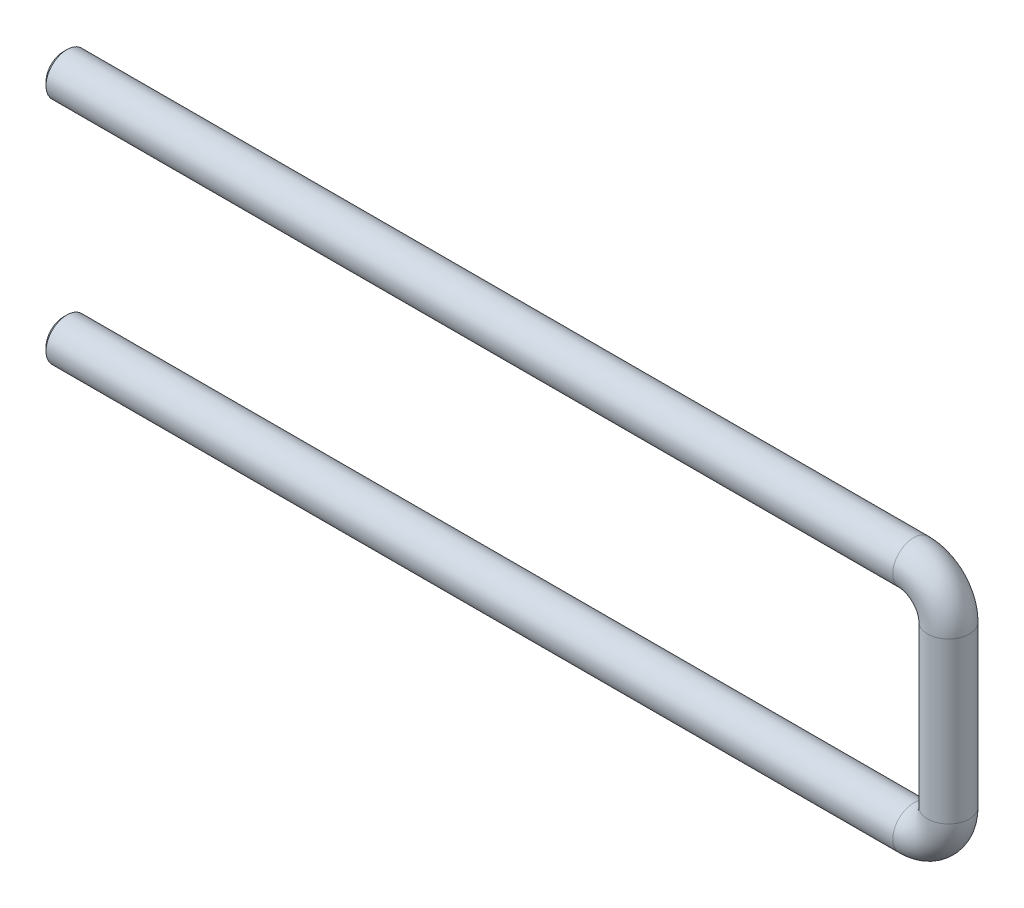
ISO-10303-21;
HEADER;
FILE_DESCRIPTION(('STEP AP214'),'2;1');
FILE_NAME('part.step','',(''),(''),'','','');
FILE_SCHEMA(('AUTOMOTIVE_DESIGN { 1 0 10303 214 1 1 1 1 }'));
ENDSEC;
DATA;
#1=APPLICATION_CONTEXT('core data for automotive mechanical design processes');
#2=APPLICATION_PROTOCOL_DEFINITION('international standard','automotive_design',2000,#1);
#3=PRODUCT_CONTEXT('',#1,'mechanical');
#4=PRODUCT('Part','Part','',(#3));
#5=PRODUCT_RELATED_PRODUCT_CATEGORY('part','',(#4));
#6=PRODUCT_DEFINITION_FORMATION('','',#4);
#7=PRODUCT_DEFINITION_CONTEXT('part definition',#1,'design');
#8=PRODUCT_DEFINITION('design','',#6,#7);
#9=PRODUCT_DEFINITION_SHAPE('','',#8);
#10=(LENGTH_UNIT() NAMED_UNIT(*) SI_UNIT(.MILLI.,.METRE.));
#11=(NAMED_UNIT(*) PLANE_ANGLE_UNIT() SI_UNIT($,.RADIAN.));
#12=(NAMED_UNIT(*) SI_UNIT($,.STERADIAN.) SOLID_ANGLE_UNIT());
#13=UNCERTAINTY_MEASURE_WITH_UNIT(LENGTH_MEASURE(1.E-05),#10,'distance_accuracy_value','');
#14=(GEOMETRIC_REPRESENTATION_CONTEXT(3) GLOBAL_UNCERTAINTY_ASSIGNED_CONTEXT((#13)) GLOBAL_UNIT_ASSIGNED_CONTEXT((#10,
#11,#12)) REPRESENTATION_CONTEXT('',''));
#15=CARTESIAN_POINT('',(0.,0.,0.));
#16=DIRECTION('',(0.,0.,1.));
#17=DIRECTION('',(1.,0.,0.));
#18=AXIS2_PLACEMENT_3D('',#15,#16,#17);
#19=CARTESIAN_POINT('',(-47.4999509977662,-16.5000000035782,34.9654668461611));
#20=DIRECTION('',(-0.999999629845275,0.,0.000860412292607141));
#21=DIRECTION('',(0.000860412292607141,0.,0.999999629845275));
#22=AXIS2_PLACEMENT_3D('',#19,#20,#21);
#23=PLANE('',#22);
#24=CARTESIAN_POINT('',(-47.4999509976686,-16.5000000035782,34.965466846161));
#25=DIRECTION('',(0.999999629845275,0.,-0.000860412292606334));
#26=DIRECTION('',(-0.000860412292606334,0.,-0.999999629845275));
#27=AXIS2_PLACEMENT_3D('',#24,#25,#26);
#28=CIRCLE('',#27,2.50000000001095);
#29=CARTESIAN_POINT('',(-47.5021020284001,-16.5000000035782,32.4654677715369));
#30=VERTEX_POINT('',#29);
#31=EDGE_CURVE('E16',#30,#30,#28,.T.);
#32=ORIENTED_EDGE('',*,*,#31,.F.);
#33=EDGE_LOOP('',(#32));
#34=FACE_BOUND('',#33,.T.);
#35=ADVANCED_FACE('F12',(#34),#23,.T.);
#36=CARTESIAN_POINT('',(-46.9999511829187,-16.5000000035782,34.9650366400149));
#37=DIRECTION('',(0.999999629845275,0.,-0.000860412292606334));
#38=DIRECTION('',(-0.000860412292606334,0.,-0.999999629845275));
#39=AXIS2_PLACEMENT_3D('',#36,#37,#38);
#40=CONICAL_SURFACE('',#39,2.99999999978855,0.785398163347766);
#41=CARTESIAN_POINT('',(-46.9999511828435,-16.5000000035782,34.9650366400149));
#42=DIRECTION('',(-0.999999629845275,0.,0.000860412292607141));
#43=DIRECTION('',(0.000860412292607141,0.,0.999999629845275));
#44=AXIS2_PLACEMENT_3D('',#41,#42,#43);
#45=CIRCLE('',#44,3.);
#46=CARTESIAN_POINT('',(-46.9973699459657,-16.5000000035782,37.9650355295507));
#47=VERTEX_POINT('',#46);
#48=EDGE_CURVE('E38',#47,#47,#45,.F.);
#49=ORIENTED_EDGE('',*,*,#48,.F.);
#50=EDGE_LOOP('',(#49));
#51=FACE_BOUND('',#50,.T.);
#52=ORIENTED_EDGE('',*,*,#31,.T.);
#53=EDGE_LOOP('',(#52));
#54=FACE_BOUND('',#53,.T.);
#55=ADVANCED_FACE('F63',(#51,#54),#40,.T.);
#56=CARTESIAN_POINT('',(74.5000038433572,-16.5000000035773,34.8604965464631));
#57=DIRECTION('',(-0.999999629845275,0.,0.000860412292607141));
#58=DIRECTION('',(0.000860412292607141,0.,0.999999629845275));
#59=AXIS2_PLACEMENT_3D('',#56,#57,#58);
#60=CYLINDRICAL_SURFACE('',#59,3.);
#61=ORIENTED_EDGE('',*,*,#48,.T.);
#62=EDGE_LOOP('',(#61));
#63=FACE_BOUND('',#62,.T.);
#64=CARTESIAN_POINT('',(74.5000038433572,-16.5000000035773,34.8604965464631));
#65=DIRECTION('',(0.999999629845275,0.,-0.00086041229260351));
#66=DIRECTION('',(-0.00086041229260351,0.,-0.999999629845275));
#67=AXIS2_PLACEMENT_3D('',#64,#65,#66);
#68=CIRCLE('',#67,3.);
#69=CARTESIAN_POINT('',(74.5000038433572,-19.5000000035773,34.8604965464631));
#70=VERTEX_POINT('',#69);
#71=EDGE_CURVE('E35',#70,#70,#68,.T.);
#72=ORIENTED_EDGE('',*,*,#71,.F.);
#73=EDGE_LOOP('',(#72));
#74=FACE_BOUND('',#73,.T.);
#75=ADVANCED_FACE('F56',(#63,#74),#60,.T.);
#76=CARTESIAN_POINT('',(74.5000038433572,-11.5000000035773,34.860496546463));
#77=DIRECTION('',(0.000860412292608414,0.,0.999999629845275));
#78=DIRECTION('',(0.999999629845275,0.,-0.000860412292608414));
#79=AXIS2_PLACEMENT_3D('',#76,#77,#78);
#80=TOROIDAL_SURFACE('',#79,5.,3.);
#81=CARTESIAN_POINT('',(79.5000019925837,-11.5000000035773,34.856194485));
#82=DIRECTION('',(0.,1.,0.));
#83=DIRECTION('',(-1.,0.,0.));
#84=AXIS2_PLACEMENT_3D('',#81,#82,#83);
#85=CIRCLE('',#84,3.);
#86=CARTESIAN_POINT('',(82.5000008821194,-11.5000000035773,34.8536132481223));
#87=VERTEX_POINT('',#86);
#88=EDGE_CURVE('E32',#87,#87,#85,.T.);
#89=CARTESIAN_POINT('',(74.5000038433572,-11.5000000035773,34.860496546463));
#90=DIRECTION('',(0.000860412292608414,0.,0.999999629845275));
#91=DIRECTION('',(0.999999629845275,0.,-0.000860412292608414));
#92=AXIS2_PLACEMENT_3D('',#89,#90,#91);
#93=CIRCLE('',#92,8.);
#94=EDGE_CURVE('',#70,#87,#93,.T.);
#95=ORIENTED_EDGE('',*,*,#71,.T.);
#96=ORIENTED_EDGE('',*,*,#88,.F.);
#97=ORIENTED_EDGE('',*,*,#94,.T.);
#98=ORIENTED_EDGE('',*,*,#94,.F.);
#99=EDGE_LOOP('',(#95,#97,#96,#98));
#100=FACE_BOUND('',#99,.T.);
#101=ADVANCED_FACE('F51',(#100),#80,.T.);
#102=CARTESIAN_POINT('',(79.5000019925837,-11.5000000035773,34.856194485));
#103=DIRECTION('',(0.,1.,0.));
#104=DIRECTION('',(-1.,0.,0.));
#105=AXIS2_PLACEMENT_3D('',#102,#103,#104);
#106=CYLINDRICAL_SURFACE('',#105,3.);
#107=CARTESIAN_POINT('',(79.5000019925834,11.4999999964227,34.856194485));
#108=DIRECTION('',(0.,1.,0.));
#109=DIRECTION('',(-1.,0.,0.));
#110=AXIS2_PLACEMENT_3D('',#107,#108,#109);
#111=CIRCLE('',#110,3.);
#112=CARTESIAN_POINT('',(82.5000008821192,11.4999999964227,34.8536132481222));
#113=VERTEX_POINT('',#112);
#114=EDGE_CURVE('E29',#113,#113,#111,.T.);
#115=ORIENTED_EDGE('',*,*,#114,.F.);
#116=EDGE_LOOP('',(#115));
#117=FACE_BOUND('',#116,.T.);
#118=ORIENTED_EDGE('',*,*,#88,.T.);
#119=EDGE_LOOP('',(#118));
#120=FACE_BOUND('',#119,.T.);
#121=ADVANCED_FACE('F47',(#117,#120),#106,.T.);
#122=CARTESIAN_POINT('',(-47.4999509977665,16.4999999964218,34.965466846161));
#123=DIRECTION('',(0.999999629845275,0.,-0.000860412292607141));
#124=DIRECTION('',(-0.000860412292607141,0.,-0.999999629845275));
#125=AXIS2_PLACEMENT_3D('',#122,#123,#124);
#126=PLANE('',#125);
#127=CARTESIAN_POINT('',(-47.4999509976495,16.4999999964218,34.965466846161));
#128=DIRECTION('',(0.999999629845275,0.,-0.000860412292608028));
#129=DIRECTION('',(-0.000860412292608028,0.,-0.999999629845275));
#130=AXIS2_PLACEMENT_3D('',#127,#128,#129);
#131=CIRCLE('',#130,2.50000000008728);
#132=CARTESIAN_POINT('',(-47.5021020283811,16.4999999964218,32.4654677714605));
#133=VERTEX_POINT('',#132);
#134=EDGE_CURVE('E25',#133,#133,#131,.T.);
#135=ORIENTED_EDGE('',*,*,#134,.F.);
#136=EDGE_LOOP('',(#135));
#137=FACE_BOUND('',#136,.T.);
#138=ADVANCED_FACE('F50',(#137),#126,.F.);
#139=CARTESIAN_POINT('',(74.500003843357,11.4999999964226,34.8604965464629));
#140=DIRECTION('',(0.000860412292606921,0.,0.999999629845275));
#141=DIRECTION('',(0.999999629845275,0.,-0.000860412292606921));
#142=AXIS2_PLACEMENT_3D('',#139,#140,#141);
#143=TOROIDAL_SURFACE('',#142,5.,3.);
#144=CARTESIAN_POINT('',(74.500003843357,16.4999999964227,34.8604965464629));
#145=DIRECTION('',(-0.999999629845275,0.,0.000860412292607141));
#146=DIRECTION('',(0.000860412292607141,0.,0.999999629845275));
#147=AXIS2_PLACEMENT_3D('',#144,#145,#146);
#148=CIRCLE('',#147,3.);
#149=CARTESIAN_POINT('',(74.500003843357,19.4999999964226,34.8604965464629));
#150=VERTEX_POINT('',#149);
#151=EDGE_CURVE('E20',#150,#150,#148,.T.);
#152=CARTESIAN_POINT('',(74.500003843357,11.4999999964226,34.8604965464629));
#153=DIRECTION('',(0.000860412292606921,0.,0.999999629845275));
#154=DIRECTION('',(0.999999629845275,0.,-0.000860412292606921));
#155=AXIS2_PLACEMENT_3D('',#152,#153,#154);
#156=CIRCLE('',#155,8.);
#157=EDGE_CURVE('',#113,#150,#156,.T.);
#158=ORIENTED_EDGE('',*,*,#114,.T.);
#159=ORIENTED_EDGE('',*,*,#151,.F.);
#160=ORIENTED_EDGE('',*,*,#157,.T.);
#161=ORIENTED_EDGE('',*,*,#157,.F.);
#162=EDGE_LOOP('',(#158,#160,#159,#161));
#163=FACE_BOUND('',#162,.T.);
#164=ADVANCED_FACE('F14',(#163),#143,.T.);
#165=CARTESIAN_POINT('',(-46.9999511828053,16.4999999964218,34.9650366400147));
#166=DIRECTION('',(0.999999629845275,0.,-0.000860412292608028));
#167=DIRECTION('',(-0.000860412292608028,0.,-0.999999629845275));
#168=AXIS2_PLACEMENT_3D('',#165,#166,#167);
#169=CONICAL_SURFACE('',#168,3.00000000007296,0.78539816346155);
#170=ORIENTED_EDGE('',*,*,#134,.T.);
#171=EDGE_LOOP('',(#170));
#172=FACE_BOUND('',#171,.T.);
#173=CARTESIAN_POINT('',(-46.9999511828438,16.4999999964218,34.9650366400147));
#174=DIRECTION('',(-0.999999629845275,0.,0.000860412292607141));
#175=DIRECTION('',(0.000860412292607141,0.,0.999999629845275));
#176=AXIS2_PLACEMENT_3D('',#173,#174,#175);
#177=CIRCLE('',#176,3.);
#178=CARTESIAN_POINT('',(-46.997369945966,16.4999999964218,37.9650355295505));
#179=VERTEX_POINT('',#178);
#180=EDGE_CURVE('E8',#179,#179,#177,.F.);
#181=ORIENTED_EDGE('',*,*,#180,.F.);
#182=EDGE_LOOP('',(#181));
#183=FACE_BOUND('',#182,.T.);
#184=ADVANCED_FACE('F69',(#172,#183),#169,.T.);
#185=CARTESIAN_POINT('',(74.500003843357,16.4999999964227,34.8604965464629));
#186=DIRECTION('',(-0.999999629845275,0.,0.000860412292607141));
#187=DIRECTION('',(0.000860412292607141,0.,0.999999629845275));
#188=AXIS2_PLACEMENT_3D('',#185,#186,#187);
#189=CYLINDRICAL_SURFACE('',#188,3.);
#190=ORIENTED_EDGE('',*,*,#151,.T.);
#191=EDGE_LOOP('',(#190));
#192=FACE_BOUND('',#191,.T.);
#193=ORIENTED_EDGE('',*,*,#180,.T.);
#194=EDGE_LOOP('',(#193));
#195=FACE_BOUND('',#194,.T.);
#196=ADVANCED_FACE('F67',(#192,#195),#189,.T.);
#197=CLOSED_SHELL('',(#35,#55,#75,#101,#121,#138,#164,#184,#196));
#198=MANIFOLD_SOLID_BREP('B1',#197);
#199=ADVANCED_BREP_SHAPE_REPRESENTATION('',(#18,#198),#14);
#200=SHAPE_DEFINITION_REPRESENTATION(#9,#199);
ENDSEC;
END-ISO-10303-21;
